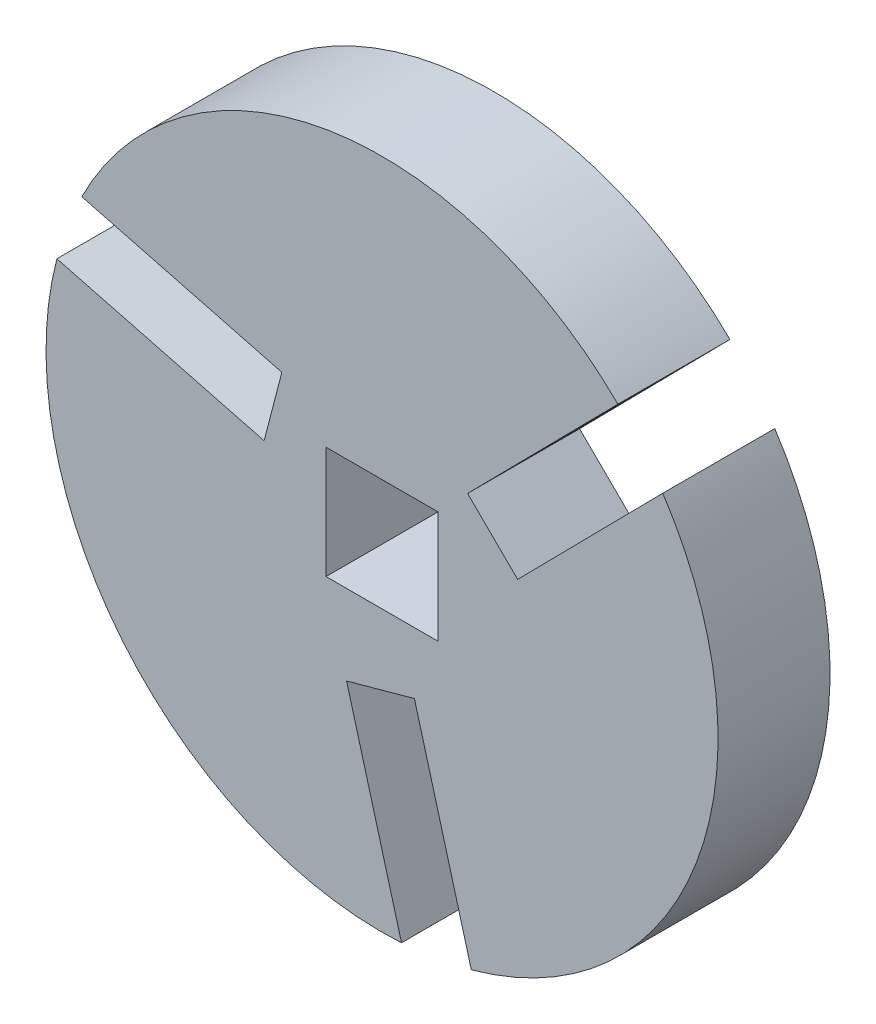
ISO-10303-21;
HEADER;
FILE_DESCRIPTION(('STEP AP214'),'2;1');
FILE_NAME('part.step','',(''),(''),'','','');
FILE_SCHEMA(('AUTOMOTIVE_DESIGN { 1 0 10303 214 1 1 1 1 }'));
ENDSEC;
DATA;
#1=APPLICATION_CONTEXT('core data for automotive mechanical design processes');
#2=APPLICATION_PROTOCOL_DEFINITION('international standard','automotive_design',2000,#1);
#3=PRODUCT_CONTEXT('',#1,'mechanical');
#4=PRODUCT('Part','Part','',(#3));
#5=PRODUCT_RELATED_PRODUCT_CATEGORY('part','',(#4));
#6=PRODUCT_DEFINITION_FORMATION('','',#4);
#7=PRODUCT_DEFINITION_CONTEXT('part definition',#1,'design');
#8=PRODUCT_DEFINITION('design','',#6,#7);
#9=PRODUCT_DEFINITION_SHAPE('','',#8);
#10=(LENGTH_UNIT() NAMED_UNIT(*) SI_UNIT(.MILLI.,.METRE.));
#11=(NAMED_UNIT(*) PLANE_ANGLE_UNIT() SI_UNIT($,.RADIAN.));
#12=(NAMED_UNIT(*) SI_UNIT($,.STERADIAN.) SOLID_ANGLE_UNIT());
#13=UNCERTAINTY_MEASURE_WITH_UNIT(LENGTH_MEASURE(1.E-05),#10,'distance_accuracy_value','');
#14=(GEOMETRIC_REPRESENTATION_CONTEXT(3) GLOBAL_UNCERTAINTY_ASSIGNED_CONTEXT((#13)) GLOBAL_UNIT_ASSIGNED_CONTEXT((#10,
#11,#12)) REPRESENTATION_CONTEXT('',''));
#15=CARTESIAN_POINT('',(0.,0.,0.));
#16=DIRECTION('',(0.,0.,1.));
#17=DIRECTION('',(1.,0.,0.));
#18=AXIS2_PLACEMENT_3D('',#15,#16,#17);
#19=CARTESIAN_POINT('',(0.,0.,6.35));
#20=DIRECTION('',(0.,0.,1.));
#21=DIRECTION('',(1.,0.,0.));
#22=AXIS2_PLACEMENT_3D('',#19,#20,#21);
#23=PLANE('',#22);
#24=DIRECTION('',(0.967740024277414,-0.251950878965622,0.));
#25=VECTOR('',#24,1.);
#26=CARTESIAN_POINT('',(-17.0219810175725,8.55304987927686,6.35));
#27=LINE('',#26,#25);
#28=CARTESIAN_POINT('',(-17.0219810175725,8.55304987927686,6.35));
#29=VERTEX_POINT('',#28);
#30=CARTESIAN_POINT('',(-5.68041153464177,5.60027503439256,6.35));
#31=VERTEX_POINT('',#30);
#32=EDGE_CURVE('E210',#29,#31,#27,.T.);
#33=ORIENTED_EDGE('',*,*,#32,.T.);
#34=DIRECTION('',(-0.251950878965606,-0.967740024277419,0.));
#35=VECTOR('',#34,1.);
#36=CARTESIAN_POINT('',(-5.68041153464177,5.60027503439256,6.35));
#37=LINE('',#36,#35);
#38=CARTESIAN_POINT('',(-6.68529887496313,1.74051592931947,6.35));
#39=VERTEX_POINT('',#38);
#40=EDGE_CURVE('E213',#31,#39,#37,.T.);
#41=ORIENTED_EDGE('',*,*,#40,.T.);
#42=DIRECTION('',(-0.967740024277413,0.251950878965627,0.));
#43=VECTOR('',#42,1.);
#44=CARTESIAN_POINT('',(-6.68529887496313,1.74051592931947,6.35));
#45=LINE('',#44,#43);
#46=CARTESIAN_POINT('',(-18.4354474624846,4.79966424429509,6.35));
#47=VERTEX_POINT('',#46);
#48=EDGE_CURVE('E217',#39,#47,#45,.T.);
#49=ORIENTED_EDGE('',*,*,#48,.T.);
#50=CARTESIAN_POINT('',(0.,0.,6.35));
#51=DIRECTION('',(0.,0.,1.));
#52=DIRECTION('',(1.,0.,0.));
#53=AXIS2_PLACEMENT_3D('',#50,#51,#52);
#54=CIRCLE('',#53,19.0499999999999);
#55=CARTESIAN_POINT('',(1.10383203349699,-19.0179929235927,6.35));
#56=VERTEX_POINT('',#55);
#57=EDGE_CURVE('E220',#47,#56,#54,.T.);
#58=ORIENTED_EDGE('',*,*,#57,.T.);
#59=DIRECTION('',(-0.265674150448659,0.964062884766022,0.));
#60=VECTOR('',#59,1.);
#61=CARTESIAN_POINT('',(1.103832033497,-19.0179929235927,6.35));
#62=LINE('',#61,#60);
#63=CARTESIAN_POINT('',(-2.00977468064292,-7.71951821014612,6.35));
#64=VERTEX_POINT('',#63);
#65=EDGE_CURVE('E223',#56,#64,#62,.T.);
#66=ORIENTED_EDGE('',*,*,#65,.T.);
#67=DIRECTION('',(0.964062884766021,0.26567415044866,0.));
#68=VECTOR('',#67,1.);
#69=CARTESIAN_POINT('',(-2.00977468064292,-7.71951821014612,6.35));
#70=LINE('',#69,#68);
#71=CARTESIAN_POINT('',(1.83531842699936,-6.65989662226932,6.35));
#72=VERTEX_POINT('',#71);
#73=EDGE_CURVE('E226',#64,#72,#70,.T.);
#74=ORIENTED_EDGE('',*,*,#73,.T.);
#75=DIRECTION('',(0.265674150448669,-0.964062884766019,0.));
#76=VECTOR('',#75,1.);
#77=CARTESIAN_POINT('',(1.83531842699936,-6.65989662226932,6.35));
#78=LINE('',#77,#76);
#79=CARTESIAN_POINT('',(5.06109256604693,-18.3653979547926,6.35));
#80=VERTEX_POINT('',#79);
#81=EDGE_CURVE('E228',#72,#80,#78,.T.);
#82=ORIENTED_EDGE('',*,*,#81,.T.);
#83=CARTESIAN_POINT('',(0.,0.,6.35));
#84=DIRECTION('',(0.,0.,1.));
#85=DIRECTION('',(1.,0.,0.));
#86=AXIS2_PLACEMENT_3D('',#83,#84,#85);
#87=CIRCLE('',#86,19.0499999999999);
#88=CARTESIAN_POINT('',(15.9181489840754,10.4649430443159,6.35));
#89=VERTEX_POINT('',#88);
#90=EDGE_CURVE('E231',#80,#89,#87,.T.);
#91=ORIENTED_EDGE('',*,*,#90,.T.);
#92=DIRECTION('',(-0.702065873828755,-0.712112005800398,0.));
#93=VECTOR('',#92,1.);
#94=CARTESIAN_POINT('',(11.3053404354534,5.78612803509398,6.35));
#95=LINE('',#94,#93);
#96=CARTESIAN_POINT('',(7.6901862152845,2.11924317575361,6.35));
#97=VERTEX_POINT('',#96);
#98=EDGE_CURVE('E234',#89,#97,#95,.T.);
#99=ORIENTED_EDGE('',*,*,#98,.T.);
#100=DIRECTION('',(-0.712112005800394,0.70206587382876,0.));
#101=VECTOR('',#100,1.);
#102=CARTESIAN_POINT('',(7.6901862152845,2.11924317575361,6.35));
#103=LINE('',#102,#101);
#104=CARTESIAN_POINT('',(4.84998044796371,4.91938069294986,6.35));
#105=VERTEX_POINT('',#104);
#106=EDGE_CURVE('E237',#97,#105,#103,.T.);
#107=ORIENTED_EDGE('',*,*,#106,.T.);
#108=DIRECTION('',(0.702065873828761,0.712112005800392,0.));
#109=VECTOR('',#108,1.);
#110=CARTESIAN_POINT('',(4.84998044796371,4.91938069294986,6.35));
#111=LINE('',#110,#109);
#112=CARTESIAN_POINT('',(13.3743548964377,13.5657337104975,6.35));
#113=VERTEX_POINT('',#112);
#114=EDGE_CURVE('E240',#105,#113,#111,.T.);
#115=ORIENTED_EDGE('',*,*,#114,.T.);
#116=CARTESIAN_POINT('',(0.,0.,6.35));
#117=DIRECTION('',(0.,0.,1.));
#118=DIRECTION('',(1.,0.,0.));
#119=AXIS2_PLACEMENT_3D('',#116,#117,#118);
#120=CIRCLE('',#119,19.0499999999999);
#121=EDGE_CURVE('E243',#113,#29,#120,.T.);
#122=ORIENTED_EDGE('',*,*,#121,.T.);
#123=EDGE_LOOP('',(#33,#41,#49,#58,#66,#74,#82,#91,#99,#107,#115,#122));
#124=FACE_BOUND('',#123,.T.);
#125=DIRECTION('',(-1.,0.,0.));
#126=VECTOR('',#125,1.);
#127=CARTESIAN_POINT('',(-3.17500000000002,3.17499999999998,6.35));
#128=LINE('',#127,#126);
#129=CARTESIAN_POINT('',(3.17499999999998,3.17499999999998,6.35));
#130=VERTEX_POINT('',#129);
#131=CARTESIAN_POINT('',(-3.17500000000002,3.17499999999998,6.35));
#132=VERTEX_POINT('',#131);
#133=EDGE_CURVE('E177',#130,#132,#128,.T.);
#134=ORIENTED_EDGE('',*,*,#133,.F.);
#135=DIRECTION('',(0.,1.,0.));
#136=VECTOR('',#135,1.);
#137=CARTESIAN_POINT('',(3.17499999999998,-3.17500000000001,6.35));
#138=LINE('',#137,#136);
#139=CARTESIAN_POINT('',(3.17499999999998,-3.17500000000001,6.35));
#140=VERTEX_POINT('',#139);
#141=EDGE_CURVE('E168',#140,#130,#138,.T.);
#142=ORIENTED_EDGE('',*,*,#141,.F.);
#143=DIRECTION('',(1.,0.,0.));
#144=VECTOR('',#143,1.);
#145=CARTESIAN_POINT('',(-3.17500000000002,-3.17500000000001,6.35));
#146=LINE('',#145,#144);
#147=CARTESIAN_POINT('',(-3.17500000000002,-3.17500000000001,6.35));
#148=VERTEX_POINT('',#147);
#149=EDGE_CURVE('E195',#148,#140,#146,.T.);
#150=ORIENTED_EDGE('',*,*,#149,.F.);
#151=DIRECTION('',(0.,-1.,0.));
#152=VECTOR('',#151,1.);
#153=CARTESIAN_POINT('',(-3.17500000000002,-3.17500000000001,6.35));
#154=LINE('',#153,#152);
#155=EDGE_CURVE('E190',#132,#148,#154,.T.);
#156=ORIENTED_EDGE('',*,*,#155,.F.);
#157=EDGE_LOOP('',(#134,#142,#150,#156));
#158=FACE_BOUND('',#157,.T.);
#159=ADVANCED_FACE('F38',(#124,#158),#23,.T.);
#160=CARTESIAN_POINT('',(0.,0.,0.));
#161=DIRECTION('',(0.,0.,1.));
#162=DIRECTION('',(1.,0.,0.));
#163=AXIS2_PLACEMENT_3D('',#160,#161,#162);
#164=PLANE('',#163);
#165=DIRECTION('',(0.967740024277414,-0.251950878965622,0.));
#166=VECTOR('',#165,1.);
#167=CARTESIAN_POINT('',(-10.6750951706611,6.90063969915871,0.));
#168=LINE('',#167,#166);
#169=CARTESIAN_POINT('',(-17.0219810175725,8.55304987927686,0.));
#170=VERTEX_POINT('',#169);
#171=CARTESIAN_POINT('',(-5.68041153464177,5.60027503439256,0.));
#172=VERTEX_POINT('',#171);
#173=EDGE_CURVE('E186',#170,#172,#168,.T.);
#174=ORIENTED_EDGE('',*,*,#173,.F.);
#175=CARTESIAN_POINT('',(0.,0.,0.));
#176=DIRECTION('',(0.,0.,1.));
#177=DIRECTION('',(1.,0.,0.));
#178=AXIS2_PLACEMENT_3D('',#175,#176,#177);
#179=CIRCLE('',#178,19.0499999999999);
#180=CARTESIAN_POINT('',(13.3743548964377,13.5657337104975,0.));
#181=VERTEX_POINT('',#180);
#182=EDGE_CURVE('E214',#181,#170,#179,.T.);
#183=ORIENTED_EDGE('',*,*,#182,.F.);
#184=DIRECTION('',(0.702065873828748,0.712112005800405,0.));
#185=VECTOR('',#184,1.);
#186=CARTESIAN_POINT('',(13.3743548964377,13.5657337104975,0.));
#187=LINE('',#186,#185);
#188=CARTESIAN_POINT('',(4.84998044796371,4.91938069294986,0.));
#189=VERTEX_POINT('',#188);
#190=EDGE_CURVE('E276',#189,#181,#187,.T.);
#191=ORIENTED_EDGE('',*,*,#190,.F.);
#192=DIRECTION('',(-0.712112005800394,0.70206587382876,0.));
#193=VECTOR('',#192,1.);
#194=CARTESIAN_POINT('',(7.6901862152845,2.11924317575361,0.));
#195=LINE('',#194,#193);
#196=CARTESIAN_POINT('',(7.6901862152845,2.11924317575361,0.));
#197=VERTEX_POINT('',#196);
#198=EDGE_CURVE('E273',#197,#189,#195,.T.);
#199=ORIENTED_EDGE('',*,*,#198,.F.);
#200=DIRECTION('',(-0.702065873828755,-0.712112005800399,0.));
#201=VECTOR('',#200,1.);
#202=CARTESIAN_POINT('',(11.3053404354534,5.78612803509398,0.));
#203=LINE('',#202,#201);
#204=CARTESIAN_POINT('',(15.9181489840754,10.4649430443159,0.));
#205=VERTEX_POINT('',#204);
#206=EDGE_CURVE('E270',#205,#197,#203,.T.);
#207=ORIENTED_EDGE('',*,*,#206,.F.);
#208=CARTESIAN_POINT('',(0.,0.,0.));
#209=DIRECTION('',(0.,0.,1.));
#210=DIRECTION('',(1.,0.,0.));
#211=AXIS2_PLACEMENT_3D('',#208,#209,#210);
#212=CIRCLE('',#211,19.0499999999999);
#213=CARTESIAN_POINT('',(5.06109256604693,-18.3653979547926,0.));
#214=VERTEX_POINT('',#213);
#215=EDGE_CURVE('E266',#214,#205,#212,.T.);
#216=ORIENTED_EDGE('',*,*,#215,.F.);
#217=DIRECTION('',(0.265674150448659,-0.964062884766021,0.));
#218=VECTOR('',#217,1.);
#219=CARTESIAN_POINT('',(3.37406171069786,-12.2435986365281,0.));
#220=LINE('',#219,#218);
#221=CARTESIAN_POINT('',(1.83531842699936,-6.65989662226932,0.));
#222=VERTEX_POINT('',#221);
#223=EDGE_CURVE('E264',#222,#214,#220,.T.);
#224=ORIENTED_EDGE('',*,*,#223,.F.);
#225=DIRECTION('',(0.964062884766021,0.26567415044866,0.));
#226=VECTOR('',#225,1.);
#227=CARTESIAN_POINT('',(-2.00977468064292,-7.71951821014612,0.));
#228=LINE('',#227,#226);
#229=CARTESIAN_POINT('',(-2.00977468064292,-7.71951821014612,0.));
#230=VERTEX_POINT('',#229);
#231=EDGE_CURVE('E261',#230,#222,#228,.T.);
#232=ORIENTED_EDGE('',*,*,#231,.F.);
#233=DIRECTION('',(-0.265674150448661,0.964062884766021,0.));
#234=VECTOR('',#233,1.);
#235=CARTESIAN_POINT('',(-0.641736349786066,-12.683776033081,0.));
#236=LINE('',#235,#234);
#237=CARTESIAN_POINT('',(1.10383203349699,-19.0179929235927,0.));
#238=VERTEX_POINT('',#237);
#239=EDGE_CURVE('E259',#238,#230,#236,.T.);
#240=ORIENTED_EDGE('',*,*,#239,.F.);
#241=CARTESIAN_POINT('',(0.,0.,0.));
#242=DIRECTION('',(0.,0.,1.));
#243=DIRECTION('',(1.,0.,0.));
#244=AXIS2_PLACEMENT_3D('',#241,#242,#243);
#245=CIRCLE('',#244,19.0499999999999);
#246=CARTESIAN_POINT('',(-18.4354474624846,4.79966424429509,0.));
#247=VERTEX_POINT('',#246);
#248=EDGE_CURVE('E255',#247,#238,#245,.T.);
#249=ORIENTED_EDGE('',*,*,#248,.F.);
#250=DIRECTION('',(-0.967740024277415,0.251950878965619,0.));
#251=VECTOR('',#250,1.);
#252=CARTESIAN_POINT('',(-12.2902983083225,3.19977616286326,0.));
#253=LINE('',#252,#251);
#254=CARTESIAN_POINT('',(-6.68529887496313,1.74051592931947,0.));
#255=VERTEX_POINT('',#254);
#256=EDGE_CURVE('E252',#255,#247,#253,.T.);
#257=ORIENTED_EDGE('',*,*,#256,.F.);
#258=DIRECTION('',(-0.251950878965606,-0.967740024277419,0.));
#259=VECTOR('',#258,1.);
#260=CARTESIAN_POINT('',(-5.68041153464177,5.60027503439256,0.));
#261=LINE('',#260,#259);
#262=EDGE_CURVE('E249',#172,#255,#261,.T.);
#263=ORIENTED_EDGE('',*,*,#262,.F.);
#264=EDGE_LOOP('',(#174,#183,#191,#199,#207,#216,#224,#232,#240,#249,#257,#263));
#265=FACE_BOUND('',#264,.T.);
#266=DIRECTION('',(0.,1.,0.));
#267=VECTOR('',#266,1.);
#268=CARTESIAN_POINT('',(3.17499999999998,-3.17500000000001,0.));
#269=LINE('',#268,#267);
#270=CARTESIAN_POINT('',(3.17499999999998,-3.17500000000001,0.));
#271=VERTEX_POINT('',#270);
#272=CARTESIAN_POINT('',(3.17499999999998,3.17499999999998,0.));
#273=VERTEX_POINT('',#272);
#274=EDGE_CURVE('E62',#271,#273,#269,.T.);
#275=ORIENTED_EDGE('',*,*,#274,.T.);
#276=DIRECTION('',(-1.,0.,0.));
#277=VECTOR('',#276,1.);
#278=CARTESIAN_POINT('',(-3.17500000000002,3.17499999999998,0.));
#279=LINE('',#278,#277);
#280=CARTESIAN_POINT('',(-3.17500000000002,3.17499999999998,0.));
#281=VERTEX_POINT('',#280);
#282=EDGE_CURVE('E184',#273,#281,#279,.T.);
#283=ORIENTED_EDGE('',*,*,#282,.T.);
#284=DIRECTION('',(0.,-1.,0.));
#285=VECTOR('',#284,1.);
#286=CARTESIAN_POINT('',(-3.17500000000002,-3.17500000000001,0.));
#287=LINE('',#286,#285);
#288=CARTESIAN_POINT('',(-3.17500000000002,-3.17500000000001,0.));
#289=VERTEX_POINT('',#288);
#290=EDGE_CURVE('E201',#281,#289,#287,.T.);
#291=ORIENTED_EDGE('',*,*,#290,.T.);
#292=DIRECTION('',(1.,0.,0.));
#293=VECTOR('',#292,1.);
#294=CARTESIAN_POINT('',(-3.17500000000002,-3.17500000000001,0.));
#295=LINE('',#294,#293);
#296=EDGE_CURVE('E178',#289,#271,#295,.T.);
#297=ORIENTED_EDGE('',*,*,#296,.T.);
#298=EDGE_LOOP('',(#275,#283,#291,#297));
#299=FACE_BOUND('',#298,.T.);
#300=ADVANCED_FACE('F330',(#265,#299),#164,.F.);
#301=CARTESIAN_POINT('',(-10.6750951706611,6.90063969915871,6.35));
#302=DIRECTION('',(0.251950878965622,0.967740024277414,0.));
#303=DIRECTION('',(-0.967740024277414,0.251950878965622,0.));
#304=AXIS2_PLACEMENT_3D('',#301,#302,#303);
#305=PLANE('',#304);
#306=ORIENTED_EDGE('',*,*,#173,.T.);
#307=DIRECTION('',(0.,0.,-1.));
#308=VECTOR('',#307,1.);
#309=CARTESIAN_POINT('',(-5.68041153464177,5.60027503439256,6.35));
#310=LINE('',#309,#308);
#311=EDGE_CURVE('E11',#31,#172,#310,.T.);
#312=ORIENTED_EDGE('',*,*,#311,.F.);
#313=ORIENTED_EDGE('',*,*,#32,.F.);
#314=DIRECTION('',(0.,0.,-1.));
#315=VECTOR('',#314,1.);
#316=CARTESIAN_POINT('',(-17.0219810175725,8.55304987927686,6.35));
#317=LINE('',#316,#315);
#318=EDGE_CURVE('E246',#29,#170,#317,.T.);
#319=ORIENTED_EDGE('',*,*,#318,.T.);
#320=EDGE_LOOP('',(#306,#312,#313,#319));
#321=FACE_BOUND('',#320,.T.);
#322=ADVANCED_FACE('F40',(#321),#305,.F.);
#323=CARTESIAN_POINT('',(-5.68041153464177,5.60027503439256,6.35));
#324=DIRECTION('',(0.967740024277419,-0.251950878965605,0.));
#325=DIRECTION('',(0.251950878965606,0.967740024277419,0.));
#326=AXIS2_PLACEMENT_3D('',#323,#324,#325);
#327=PLANE('',#326);
#328=ORIENTED_EDGE('',*,*,#262,.T.);
#329=DIRECTION('',(0.,0.,-1.));
#330=VECTOR('',#329,1.);
#331=CARTESIAN_POINT('',(-6.68529887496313,1.74051592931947,6.35));
#332=LINE('',#331,#330);
#333=EDGE_CURVE('E47',#39,#255,#332,.T.);
#334=ORIENTED_EDGE('',*,*,#333,.F.);
#335=ORIENTED_EDGE('',*,*,#40,.F.);
#336=ORIENTED_EDGE('',*,*,#311,.T.);
#337=EDGE_LOOP('',(#328,#334,#335,#336));
#338=FACE_BOUND('',#337,.T.);
#339=ADVANCED_FACE('F326',(#338),#327,.F.);
#340=CARTESIAN_POINT('',(-12.2902983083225,3.19977616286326,6.35));
#341=DIRECTION('',(-0.251950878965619,-0.967740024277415,0.));
#342=DIRECTION('',(0.967740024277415,-0.251950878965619,0.));
#343=AXIS2_PLACEMENT_3D('',#340,#341,#342);
#344=PLANE('',#343);
#345=ORIENTED_EDGE('',*,*,#256,.T.);
#346=DIRECTION('',(0.,0.,-1.));
#347=VECTOR('',#346,1.);
#348=CARTESIAN_POINT('',(-18.4354474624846,4.79966424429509,6.35));
#349=LINE('',#348,#347);
#350=EDGE_CURVE('E314',#47,#247,#349,.T.);
#351=ORIENTED_EDGE('',*,*,#350,.F.);
#352=ORIENTED_EDGE('',*,*,#48,.F.);
#353=ORIENTED_EDGE('',*,*,#333,.T.);
#354=EDGE_LOOP('',(#345,#351,#352,#353));
#355=FACE_BOUND('',#354,.T.);
#356=ADVANCED_FACE('F322',(#355),#344,.F.);
#357=CARTESIAN_POINT('',(0.,0.,6.35));
#358=DIRECTION('',(0.,0.,-1.));
#359=DIRECTION('',(-1.,0.,0.));
#360=AXIS2_PLACEMENT_3D('',#357,#358,#359);
#361=CYLINDRICAL_SURFACE('',#360,19.0499999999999);
#362=ORIENTED_EDGE('',*,*,#248,.T.);
#363=DIRECTION('',(0.,0.,-1.));
#364=VECTOR('',#363,1.);
#365=CARTESIAN_POINT('',(1.10383203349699,-19.0179929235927,6.35));
#366=LINE('',#365,#364);
#367=EDGE_CURVE('E310',#56,#238,#366,.T.);
#368=ORIENTED_EDGE('',*,*,#367,.F.);
#369=ORIENTED_EDGE('',*,*,#57,.F.);
#370=ORIENTED_EDGE('',*,*,#350,.T.);
#371=EDGE_LOOP('',(#362,#368,#369,#370));
#372=FACE_BOUND('',#371,.T.);
#373=ADVANCED_FACE('F337',(#372),#361,.T.);
#374=CARTESIAN_POINT('',(-0.641736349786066,-12.683776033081,6.35));
#375=DIRECTION('',(-0.964062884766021,-0.265674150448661,0.));
#376=DIRECTION('',(0.265674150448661,-0.964062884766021,0.));
#377=AXIS2_PLACEMENT_3D('',#374,#375,#376);
#378=PLANE('',#377);
#379=ORIENTED_EDGE('',*,*,#239,.T.);
#380=DIRECTION('',(0.,0.,-1.));
#381=VECTOR('',#380,1.);
#382=CARTESIAN_POINT('',(-2.00977468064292,-7.71951821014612,6.35));
#383=LINE('',#382,#381);
#384=EDGE_CURVE('E307',#64,#230,#383,.T.);
#385=ORIENTED_EDGE('',*,*,#384,.F.);
#386=ORIENTED_EDGE('',*,*,#65,.F.);
#387=ORIENTED_EDGE('',*,*,#367,.T.);
#388=EDGE_LOOP('',(#379,#385,#386,#387));
#389=FACE_BOUND('',#388,.T.);
#390=ADVANCED_FACE('F341',(#389),#378,.F.);
#391=CARTESIAN_POINT('',(-2.00977468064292,-7.71951821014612,6.35));
#392=DIRECTION('',(-0.26567415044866,0.964062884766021,0.));
#393=DIRECTION('',(-0.964062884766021,-0.26567415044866,0.));
#394=AXIS2_PLACEMENT_3D('',#391,#392,#393);
#395=PLANE('',#394);
#396=ORIENTED_EDGE('',*,*,#231,.T.);
#397=DIRECTION('',(0.,0.,-1.));
#398=VECTOR('',#397,1.);
#399=CARTESIAN_POINT('',(1.83531842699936,-6.65989662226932,6.35));
#400=LINE('',#399,#398);
#401=EDGE_CURVE('E304',#72,#222,#400,.T.);
#402=ORIENTED_EDGE('',*,*,#401,.F.);
#403=ORIENTED_EDGE('',*,*,#73,.F.);
#404=ORIENTED_EDGE('',*,*,#384,.T.);
#405=EDGE_LOOP('',(#396,#402,#403,#404));
#406=FACE_BOUND('',#405,.T.);
#407=ADVANCED_FACE('F375',(#406),#395,.F.);
#408=CARTESIAN_POINT('',(3.37406171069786,-12.2435986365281,6.35));
#409=DIRECTION('',(0.964062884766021,0.265674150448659,0.));
#410=DIRECTION('',(-0.265674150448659,0.964062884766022,0.));
#411=AXIS2_PLACEMENT_3D('',#408,#409,#410);
#412=PLANE('',#411);
#413=ORIENTED_EDGE('',*,*,#223,.T.);
#414=DIRECTION('',(0.,0.,-1.));
#415=VECTOR('',#414,1.);
#416=CARTESIAN_POINT('',(5.06109256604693,-18.3653979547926,6.35));
#417=LINE('',#416,#415);
#418=EDGE_CURVE('E300',#80,#214,#417,.T.);
#419=ORIENTED_EDGE('',*,*,#418,.F.);
#420=ORIENTED_EDGE('',*,*,#81,.F.);
#421=ORIENTED_EDGE('',*,*,#401,.T.);
#422=EDGE_LOOP('',(#413,#419,#420,#421));
#423=FACE_BOUND('',#422,.T.);
#424=ADVANCED_FACE('F373',(#423),#412,.F.);
#425=CARTESIAN_POINT('',(0.,0.,6.35));
#426=DIRECTION('',(0.,0.,-1.));
#427=DIRECTION('',(-1.,0.,0.));
#428=AXIS2_PLACEMENT_3D('',#425,#426,#427);
#429=CYLINDRICAL_SURFACE('',#428,19.0499999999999);
#430=ORIENTED_EDGE('',*,*,#215,.T.);
#431=DIRECTION('',(0.,0.,-1.));
#432=VECTOR('',#431,1.);
#433=CARTESIAN_POINT('',(15.9181489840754,10.4649430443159,6.35));
#434=LINE('',#433,#432);
#435=EDGE_CURVE('E296',#89,#205,#434,.T.);
#436=ORIENTED_EDGE('',*,*,#435,.F.);
#437=ORIENTED_EDGE('',*,*,#90,.F.);
#438=ORIENTED_EDGE('',*,*,#418,.T.);
#439=EDGE_LOOP('',(#430,#436,#437,#438));
#440=FACE_BOUND('',#439,.T.);
#441=ADVANCED_FACE('F369',(#440),#429,.T.);
#442=CARTESIAN_POINT('',(11.3053404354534,5.78612803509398,6.35));
#443=DIRECTION('',(0.712112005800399,-0.702065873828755,0.));
#444=DIRECTION('',(0.702065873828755,0.712112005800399,0.));
#445=AXIS2_PLACEMENT_3D('',#442,#443,#444);
#446=PLANE('',#445);
#447=ORIENTED_EDGE('',*,*,#206,.T.);
#448=DIRECTION('',(0.,0.,-1.));
#449=VECTOR('',#448,1.);
#450=CARTESIAN_POINT('',(7.6901862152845,2.11924317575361,6.35));
#451=LINE('',#450,#449);
#452=EDGE_CURVE('E292',#97,#197,#451,.T.);
#453=ORIENTED_EDGE('',*,*,#452,.F.);
#454=ORIENTED_EDGE('',*,*,#98,.F.);
#455=ORIENTED_EDGE('',*,*,#435,.T.);
#456=EDGE_LOOP('',(#447,#453,#454,#455));
#457=FACE_BOUND('',#456,.T.);
#458=ADVANCED_FACE('F366',(#457),#446,.F.);
#459=CARTESIAN_POINT('',(7.6901862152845,2.11924317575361,6.35));
#460=DIRECTION('',(-0.70206587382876,-0.712112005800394,0.));
#461=DIRECTION('',(0.712112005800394,-0.70206587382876,0.));
#462=AXIS2_PLACEMENT_3D('',#459,#460,#461);
#463=PLANE('',#462);
#464=ORIENTED_EDGE('',*,*,#198,.T.);
#465=DIRECTION('',(0.,0.,-1.));
#466=VECTOR('',#465,1.);
#467=CARTESIAN_POINT('',(4.84998044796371,4.91938069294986,6.35));
#468=LINE('',#467,#466);
#469=EDGE_CURVE('E289',#105,#189,#468,.T.);
#470=ORIENTED_EDGE('',*,*,#469,.F.);
#471=ORIENTED_EDGE('',*,*,#106,.F.);
#472=ORIENTED_EDGE('',*,*,#452,.T.);
#473=EDGE_LOOP('',(#464,#470,#471,#472));
#474=FACE_BOUND('',#473,.T.);
#475=ADVANCED_FACE('F357',(#474),#463,.F.);
#476=CARTESIAN_POINT('',(13.3743548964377,13.5657337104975,6.35));
#477=DIRECTION('',(-0.712112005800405,0.702065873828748,0.));
#478=DIRECTION('',(-0.702065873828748,-0.712112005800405,0.));
#479=AXIS2_PLACEMENT_3D('',#476,#477,#478);
#480=PLANE('',#479);
#481=ORIENTED_EDGE('',*,*,#190,.T.);
#482=DIRECTION('',(0.,0.,-1.));
#483=VECTOR('',#482,1.);
#484=CARTESIAN_POINT('',(13.3743548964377,13.5657337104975,6.35));
#485=LINE('',#484,#483);
#486=EDGE_CURVE('E285',#113,#181,#485,.T.);
#487=ORIENTED_EDGE('',*,*,#486,.F.);
#488=ORIENTED_EDGE('',*,*,#114,.F.);
#489=ORIENTED_EDGE('',*,*,#469,.T.);
#490=EDGE_LOOP('',(#481,#487,#488,#489));
#491=FACE_BOUND('',#490,.T.);
#492=ADVANCED_FACE('F361',(#491),#480,.F.);
#493=CARTESIAN_POINT('',(0.,0.,6.35));
#494=DIRECTION('',(0.,0.,-1.));
#495=DIRECTION('',(-1.,0.,0.));
#496=AXIS2_PLACEMENT_3D('',#493,#494,#495);
#497=CYLINDRICAL_SURFACE('',#496,19.0499999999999);
#498=ORIENTED_EDGE('',*,*,#182,.T.);
#499=ORIENTED_EDGE('',*,*,#318,.F.);
#500=ORIENTED_EDGE('',*,*,#121,.F.);
#501=ORIENTED_EDGE('',*,*,#486,.T.);
#502=EDGE_LOOP('',(#498,#499,#500,#501));
#503=FACE_BOUND('',#502,.T.);
#504=ADVANCED_FACE('F351',(#503),#497,.T.);
#505=CARTESIAN_POINT('',(3.17499999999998,-3.17500000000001,6.35));
#506=DIRECTION('',(-1.,0.,0.));
#507=DIRECTION('',(0.,0.,1.));
#508=AXIS2_PLACEMENT_3D('',#505,#506,#507);
#509=PLANE('',#508);
#510=ORIENTED_EDGE('',*,*,#274,.F.);
#511=DIRECTION('',(0.,0.,-1.));
#512=VECTOR('',#511,1.);
#513=CARTESIAN_POINT('',(3.17499999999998,-3.17500000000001,6.35));
#514=LINE('',#513,#512);
#515=EDGE_CURVE('E172',#140,#271,#514,.T.);
#516=ORIENTED_EDGE('',*,*,#515,.F.);
#517=ORIENTED_EDGE('',*,*,#141,.T.);
#518=DIRECTION('',(0.,0.,-1.));
#519=VECTOR('',#518,1.);
#520=CARTESIAN_POINT('',(3.17499999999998,3.17499999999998,6.35));
#521=LINE('',#520,#519);
#522=EDGE_CURVE('E171',#130,#273,#521,.T.);
#523=ORIENTED_EDGE('',*,*,#522,.T.);
#524=EDGE_LOOP('',(#510,#516,#517,#523));
#525=FACE_BOUND('',#524,.T.);
#526=ADVANCED_FACE('F170',(#525),#509,.T.);
#527=CARTESIAN_POINT('',(-3.17500000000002,3.17499999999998,6.35));
#528=DIRECTION('',(0.,-1.,0.));
#529=DIRECTION('',(0.,0.,-1.));
#530=AXIS2_PLACEMENT_3D('',#527,#528,#529);
#531=PLANE('',#530);
#532=ORIENTED_EDGE('',*,*,#282,.F.);
#533=ORIENTED_EDGE('',*,*,#522,.F.);
#534=ORIENTED_EDGE('',*,*,#133,.T.);
#535=DIRECTION('',(0.,0.,-1.));
#536=VECTOR('',#535,1.);
#537=CARTESIAN_POINT('',(-3.17500000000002,3.17499999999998,6.35));
#538=LINE('',#537,#536);
#539=EDGE_CURVE('E187',#132,#281,#538,.T.);
#540=ORIENTED_EDGE('',*,*,#539,.T.);
#541=EDGE_LOOP('',(#532,#533,#534,#540));
#542=FACE_BOUND('',#541,.T.);
#543=ADVANCED_FACE('F181',(#542),#531,.T.);
#544=CARTESIAN_POINT('',(-3.17500000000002,-3.17500000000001,6.35));
#545=DIRECTION('',(1.,0.,0.));
#546=DIRECTION('',(0.,0.,-1.));
#547=AXIS2_PLACEMENT_3D('',#544,#545,#546);
#548=PLANE('',#547);
#549=ORIENTED_EDGE('',*,*,#290,.F.);
#550=ORIENTED_EDGE('',*,*,#539,.F.);
#551=ORIENTED_EDGE('',*,*,#155,.T.);
#552=DIRECTION('',(0.,0.,-1.));
#553=VECTOR('',#552,1.);
#554=CARTESIAN_POINT('',(-3.17500000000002,-3.17500000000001,6.35));
#555=LINE('',#554,#553);
#556=EDGE_CURVE('E54',#148,#289,#555,.T.);
#557=ORIENTED_EDGE('',*,*,#556,.T.);
#558=EDGE_LOOP('',(#549,#550,#551,#557));
#559=FACE_BOUND('',#558,.T.);
#560=ADVANCED_FACE('F432',(#559),#548,.T.);
#561=CARTESIAN_POINT('',(-3.17500000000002,-3.17500000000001,6.35));
#562=DIRECTION('',(0.,1.,0.));
#563=DIRECTION('',(0.,0.,1.));
#564=AXIS2_PLACEMENT_3D('',#561,#562,#563);
#565=PLANE('',#564);
#566=ORIENTED_EDGE('',*,*,#296,.F.);
#567=ORIENTED_EDGE('',*,*,#556,.F.);
#568=ORIENTED_EDGE('',*,*,#149,.T.);
#569=ORIENTED_EDGE('',*,*,#515,.T.);
#570=EDGE_LOOP('',(#566,#567,#568,#569));
#571=FACE_BOUND('',#570,.T.);
#572=ADVANCED_FACE('F438',(#571),#565,.T.);
#573=CLOSED_SHELL('',(#159,#300,#322,#339,#356,#373,#390,#407,#424,#441,#458,#475,#492,#504,
#526,#543,#560,#572));
#574=MANIFOLD_SOLID_BREP('B2',#573);
#575=ADVANCED_BREP_SHAPE_REPRESENTATION('',(#18,#574),#14);
#576=SHAPE_DEFINITION_REPRESENTATION(#9,#575);
ENDSEC;
END-ISO-10303-21;
